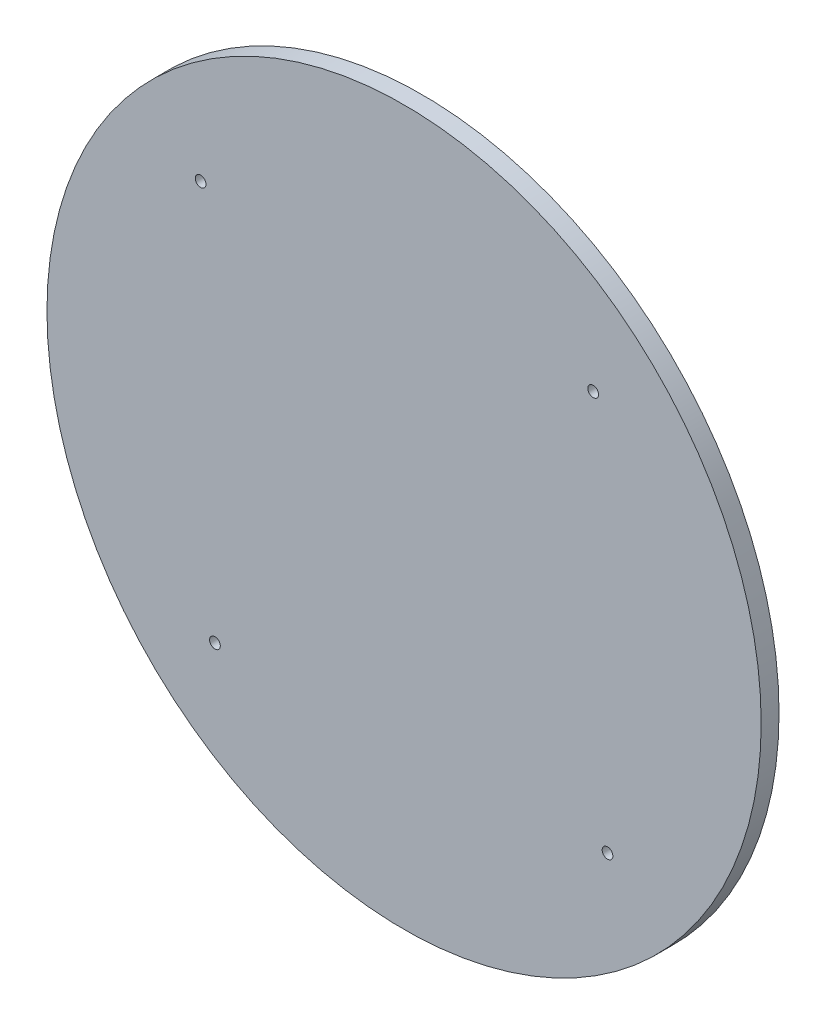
ISO-10303-21;
HEADER;
FILE_DESCRIPTION(('STEP AP214'),'2;1');
FILE_NAME('part.step','',(''),(''),'','','');
FILE_SCHEMA(('AUTOMOTIVE_DESIGN { 1 0 10303 214 1 1 1 1 }'));
ENDSEC;
DATA;
#1=APPLICATION_CONTEXT('core data for automotive mechanical design processes');
#2=APPLICATION_PROTOCOL_DEFINITION('international standard','automotive_design',2000,#1);
#3=PRODUCT_CONTEXT('',#1,'mechanical');
#4=PRODUCT('Part','Part','',(#3));
#5=PRODUCT_RELATED_PRODUCT_CATEGORY('part','',(#4));
#6=PRODUCT_DEFINITION_FORMATION('','',#4);
#7=PRODUCT_DEFINITION_CONTEXT('part definition',#1,'design');
#8=PRODUCT_DEFINITION('design','',#6,#7);
#9=PRODUCT_DEFINITION_SHAPE('','',#8);
#10=(LENGTH_UNIT() NAMED_UNIT(*) SI_UNIT(.MILLI.,.METRE.));
#11=(NAMED_UNIT(*) PLANE_ANGLE_UNIT() SI_UNIT($,.RADIAN.));
#12=(NAMED_UNIT(*) SI_UNIT($,.STERADIAN.) SOLID_ANGLE_UNIT());
#13=UNCERTAINTY_MEASURE_WITH_UNIT(LENGTH_MEASURE(1.E-05),#10,'distance_accuracy_value','');
#14=(GEOMETRIC_REPRESENTATION_CONTEXT(3) GLOBAL_UNCERTAINTY_ASSIGNED_CONTEXT((#13)) GLOBAL_UNIT_ASSIGNED_CONTEXT((#10,
#11,#12)) REPRESENTATION_CONTEXT('',''));
#15=CARTESIAN_POINT('',(0.,0.,0.));
#16=DIRECTION('',(0.,0.,1.));
#17=DIRECTION('',(1.,0.,0.));
#18=AXIS2_PLACEMENT_3D('',#15,#16,#17);
#19=CARTESIAN_POINT('',(0.,0.,0.));
#20=DIRECTION('',(0.,0.,1.));
#21=DIRECTION('',(1.,0.,0.));
#22=AXIS2_PLACEMENT_3D('',#19,#20,#21);
#23=PLANE('',#22);
#24=CARTESIAN_POINT('',(0.,0.,0.));
#25=DIRECTION('',(0.,0.,1.));
#26=DIRECTION('',(1.,0.,0.));
#27=AXIS2_PLACEMENT_3D('',#24,#25,#26);
#28=CIRCLE('',#27,100.);
#29=CARTESIAN_POINT('',(100.,0.,0.));
#30=VERTEX_POINT('',#29);
#31=EDGE_CURVE('E35',#30,#30,#28,.T.);
#32=ORIENTED_EDGE('',*,*,#31,.F.);
#33=EDGE_LOOP('',(#32));
#34=FACE_BOUND('',#33,.T.);
#35=CARTESIAN_POINT('',(-56.9668289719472,52.9601774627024,0.));
#36=DIRECTION('',(0.,0.,-1.));
#37=DIRECTION('',(-1.,0.,0.));
#38=AXIS2_PLACEMENT_3D('',#35,#36,#37);
#39=CIRCLE('',#38,1.49999999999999);
#40=CARTESIAN_POINT('',(-58.4668289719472,52.9601774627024,0.));
#41=VERTEX_POINT('',#40);
#42=EDGE_CURVE('E46',#41,#41,#39,.T.);
#43=ORIENTED_EDGE('',*,*,#42,.F.);
#44=EDGE_LOOP('',(#43));
#45=FACE_BOUND('',#44,.T.);
#46=CARTESIAN_POINT('',(52.9601774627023,56.9668289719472,0.));
#47=DIRECTION('',(0.,0.,-1.));
#48=DIRECTION('',(-1.,0.,0.));
#49=AXIS2_PLACEMENT_3D('',#46,#47,#48);
#50=CIRCLE('',#49,1.49999999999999);
#51=CARTESIAN_POINT('',(51.4601774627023,56.9668289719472,0.));
#52=VERTEX_POINT('',#51);
#53=EDGE_CURVE('E52',#52,#52,#50,.T.);
#54=ORIENTED_EDGE('',*,*,#53,.F.);
#55=EDGE_LOOP('',(#54));
#56=FACE_BOUND('',#55,.T.);
#57=CARTESIAN_POINT('',(-52.9601774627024,-56.9668289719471,0.));
#58=DIRECTION('',(0.,0.,-1.));
#59=DIRECTION('',(-1.,0.,0.));
#60=AXIS2_PLACEMENT_3D('',#57,#58,#59);
#61=CIRCLE('',#60,1.49999999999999);
#62=CARTESIAN_POINT('',(-54.4601774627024,-56.9668289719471,0.));
#63=VERTEX_POINT('',#62);
#64=EDGE_CURVE('E58',#63,#63,#61,.T.);
#65=ORIENTED_EDGE('',*,*,#64,.F.);
#66=EDGE_LOOP('',(#65));
#67=FACE_BOUND('',#66,.T.);
#68=CARTESIAN_POINT('',(56.9668289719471,-52.9601774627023,0.));
#69=DIRECTION('',(0.,0.,-1.));
#70=DIRECTION('',(-1.,0.,0.));
#71=AXIS2_PLACEMENT_3D('',#68,#69,#70);
#72=CIRCLE('',#71,1.49999999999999);
#73=CARTESIAN_POINT('',(55.4668289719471,-52.9601774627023,0.));
#74=VERTEX_POINT('',#73);
#75=EDGE_CURVE('E64',#74,#74,#72,.T.);
#76=ORIENTED_EDGE('',*,*,#75,.F.);
#77=EDGE_LOOP('',(#76));
#78=FACE_BOUND('',#77,.T.);
#79=ADVANCED_FACE('F31',(#34,#45,#56,#67,#78),#23,.F.);
#80=CARTESIAN_POINT('',(0.,0.,5.));
#81=DIRECTION('',(0.,0.,-1.));
#82=DIRECTION('',(-1.,0.,0.));
#83=AXIS2_PLACEMENT_3D('',#80,#81,#82);
#84=CYLINDRICAL_SURFACE('',#83,100.);
#85=CARTESIAN_POINT('',(0.,0.,5.));
#86=DIRECTION('',(0.,0.,1.));
#87=DIRECTION('',(1.,0.,0.));
#88=AXIS2_PLACEMENT_3D('',#85,#86,#87);
#89=CIRCLE('',#88,100.);
#90=CARTESIAN_POINT('',(100.,0.,5.));
#91=VERTEX_POINT('',#90);
#92=EDGE_CURVE('E10',#91,#91,#89,.T.);
#93=ORIENTED_EDGE('',*,*,#92,.F.);
#94=EDGE_LOOP('',(#93));
#95=FACE_BOUND('',#94,.T.);
#96=ORIENTED_EDGE('',*,*,#31,.T.);
#97=EDGE_LOOP('',(#96));
#98=FACE_BOUND('',#97,.T.);
#99=ADVANCED_FACE('F33',(#95,#98),#84,.T.);
#100=CARTESIAN_POINT('',(0.,0.,5.));
#101=DIRECTION('',(0.,0.,1.));
#102=DIRECTION('',(1.,0.,0.));
#103=AXIS2_PLACEMENT_3D('',#100,#101,#102);
#104=PLANE('',#103);
#105=CARTESIAN_POINT('',(56.9668289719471,-52.9601774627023,5.));
#106=DIRECTION('',(0.,0.,1.));
#107=DIRECTION('',(1.,0.,0.));
#108=AXIS2_PLACEMENT_3D('',#105,#106,#107);
#109=CIRCLE('',#108,1.49999999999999);
#110=CARTESIAN_POINT('',(58.4668289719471,-52.9601774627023,5.));
#111=VERTEX_POINT('',#110);
#112=EDGE_CURVE('E61',#111,#111,#109,.T.);
#113=ORIENTED_EDGE('',*,*,#112,.F.);
#114=EDGE_LOOP('',(#113));
#115=FACE_BOUND('',#114,.T.);
#116=CARTESIAN_POINT('',(-52.9601774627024,-56.9668289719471,5.));
#117=DIRECTION('',(0.,0.,1.));
#118=DIRECTION('',(1.,0.,0.));
#119=AXIS2_PLACEMENT_3D('',#116,#117,#118);
#120=CIRCLE('',#119,1.49999999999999);
#121=CARTESIAN_POINT('',(-51.4601774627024,-56.9668289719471,5.));
#122=VERTEX_POINT('',#121);
#123=EDGE_CURVE('E55',#122,#122,#120,.T.);
#124=ORIENTED_EDGE('',*,*,#123,.F.);
#125=EDGE_LOOP('',(#124));
#126=FACE_BOUND('',#125,.T.);
#127=CARTESIAN_POINT('',(52.9601774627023,56.9668289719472,5.));
#128=DIRECTION('',(0.,0.,1.));
#129=DIRECTION('',(1.,0.,0.));
#130=AXIS2_PLACEMENT_3D('',#127,#128,#129);
#131=CIRCLE('',#130,1.49999999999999);
#132=CARTESIAN_POINT('',(54.4601774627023,56.9668289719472,5.));
#133=VERTEX_POINT('',#132);
#134=EDGE_CURVE('E49',#133,#133,#131,.T.);
#135=ORIENTED_EDGE('',*,*,#134,.F.);
#136=EDGE_LOOP('',(#135));
#137=FACE_BOUND('',#136,.T.);
#138=CARTESIAN_POINT('',(-56.9668289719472,52.9601774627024,5.));
#139=DIRECTION('',(0.,0.,1.));
#140=DIRECTION('',(1.,0.,0.));
#141=AXIS2_PLACEMENT_3D('',#138,#139,#140);
#142=CIRCLE('',#141,1.49999999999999);
#143=CARTESIAN_POINT('',(-55.4668289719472,52.9601774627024,5.));
#144=VERTEX_POINT('',#143);
#145=EDGE_CURVE('E42',#144,#144,#142,.T.);
#146=ORIENTED_EDGE('',*,*,#145,.F.);
#147=EDGE_LOOP('',(#146));
#148=FACE_BOUND('',#147,.T.);
#149=ORIENTED_EDGE('',*,*,#92,.T.);
#150=EDGE_LOOP('',(#149));
#151=FACE_BOUND('',#150,.T.);
#152=ADVANCED_FACE('F76',(#115,#126,#137,#148,#151),#104,.T.);
#153=CARTESIAN_POINT('',(-56.9668289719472,52.9601774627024,0.));
#154=DIRECTION('',(0.,0.,-1.));
#155=DIRECTION('',(-1.,0.,0.));
#156=AXIS2_PLACEMENT_3D('',#153,#154,#155);
#157=CYLINDRICAL_SURFACE('',#156,1.49999999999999);
#158=ORIENTED_EDGE('',*,*,#42,.T.);
#159=EDGE_LOOP('',(#158));
#160=FACE_BOUND('',#159,.T.);
#161=ORIENTED_EDGE('',*,*,#145,.T.);
#162=EDGE_LOOP('',(#161));
#163=FACE_BOUND('',#162,.T.);
#164=ADVANCED_FACE('F83',(#160,#163),#157,.F.);
#165=CARTESIAN_POINT('',(52.9601774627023,56.9668289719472,0.));
#166=DIRECTION('',(0.,0.,-1.));
#167=DIRECTION('',(-1.,0.,0.));
#168=AXIS2_PLACEMENT_3D('',#165,#166,#167);
#169=CYLINDRICAL_SURFACE('',#168,1.49999999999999);
#170=ORIENTED_EDGE('',*,*,#53,.T.);
#171=EDGE_LOOP('',(#170));
#172=FACE_BOUND('',#171,.T.);
#173=ORIENTED_EDGE('',*,*,#134,.T.);
#174=EDGE_LOOP('',(#173));
#175=FACE_BOUND('',#174,.T.);
#176=ADVANCED_FACE('F87',(#172,#175),#169,.F.);
#177=CARTESIAN_POINT('',(-52.9601774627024,-56.9668289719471,0.));
#178=DIRECTION('',(0.,0.,-1.));
#179=DIRECTION('',(-1.,0.,0.));
#180=AXIS2_PLACEMENT_3D('',#177,#178,#179);
#181=CYLINDRICAL_SURFACE('',#180,1.49999999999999);
#182=ORIENTED_EDGE('',*,*,#64,.T.);
#183=EDGE_LOOP('',(#182));
#184=FACE_BOUND('',#183,.T.);
#185=ORIENTED_EDGE('',*,*,#123,.T.);
#186=EDGE_LOOP('',(#185));
#187=FACE_BOUND('',#186,.T.);
#188=ADVANCED_FACE('F91',(#184,#187),#181,.F.);
#189=CARTESIAN_POINT('',(56.9668289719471,-52.9601774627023,0.));
#190=DIRECTION('',(0.,0.,-1.));
#191=DIRECTION('',(-1.,0.,0.));
#192=AXIS2_PLACEMENT_3D('',#189,#190,#191);
#193=CYLINDRICAL_SURFACE('',#192,1.49999999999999);
#194=ORIENTED_EDGE('',*,*,#75,.T.);
#195=EDGE_LOOP('',(#194));
#196=FACE_BOUND('',#195,.T.);
#197=ORIENTED_EDGE('',*,*,#112,.T.);
#198=EDGE_LOOP('',(#197));
#199=FACE_BOUND('',#198,.T.);
#200=ADVANCED_FACE('F68',(#196,#199),#193,.F.);
#201=CLOSED_SHELL('',(#79,#99,#152,#164,#176,#188,#200));
#202=MANIFOLD_SOLID_BREP('B2',#201);
#203=ADVANCED_BREP_SHAPE_REPRESENTATION('',(#18,#202),#14);
#204=SHAPE_DEFINITION_REPRESENTATION(#9,#203);
ENDSEC;
END-ISO-10303-21;
